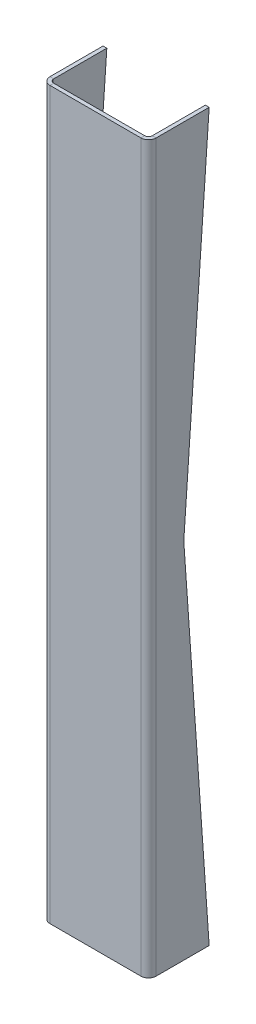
ISO-10303-21;
HEADER;
FILE_DESCRIPTION(('STEP AP214'),'2;1');
FILE_NAME('part.step','',(''),(''),'','','');
FILE_SCHEMA(('AUTOMOTIVE_DESIGN { 1 0 10303 214 1 1 1 1 }'));
ENDSEC;
DATA;
#1=APPLICATION_CONTEXT('core data for automotive mechanical design processes');
#2=APPLICATION_PROTOCOL_DEFINITION('international standard','automotive_design',2000,#1);
#3=PRODUCT_CONTEXT('',#1,'mechanical');
#4=PRODUCT('Part','Part','',(#3));
#5=PRODUCT_RELATED_PRODUCT_CATEGORY('part','',(#4));
#6=PRODUCT_DEFINITION_FORMATION('','',#4);
#7=PRODUCT_DEFINITION_CONTEXT('part definition',#1,'design');
#8=PRODUCT_DEFINITION('design','',#6,#7);
#9=PRODUCT_DEFINITION_SHAPE('','',#8);
#10=(LENGTH_UNIT() NAMED_UNIT(*) SI_UNIT(.MILLI.,.METRE.));
#11=(NAMED_UNIT(*) PLANE_ANGLE_UNIT() SI_UNIT($,.RADIAN.));
#12=(NAMED_UNIT(*) SI_UNIT($,.STERADIAN.) SOLID_ANGLE_UNIT());
#13=UNCERTAINTY_MEASURE_WITH_UNIT(LENGTH_MEASURE(1.E-05),#10,'distance_accuracy_value','');
#14=(GEOMETRIC_REPRESENTATION_CONTEXT(3) GLOBAL_UNCERTAINTY_ASSIGNED_CONTEXT((#13)) GLOBAL_UNIT_ASSIGNED_CONTEXT((#10,
#11,#12)) REPRESENTATION_CONTEXT('',''));
#15=CARTESIAN_POINT('',(0.,0.,0.));
#16=DIRECTION('',(0.,0.,1.));
#17=DIRECTION('',(1.,0.,0.));
#18=AXIS2_PLACEMENT_3D('',#15,#16,#17);
#19=CARTESIAN_POINT('',(88.9,1216.025,0.));
#20=DIRECTION('',(1.,0.,0.));
#21=DIRECTION('',(0.,0.,-1.));
#22=AXIS2_PLACEMENT_3D('',#19,#20,#21);
#23=PLANE('',#22);
#24=DIRECTION('',(0.,0.997564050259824,0.0697564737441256));
#25=VECTOR('',#24,1.);
#26=CARTESIAN_POINT('',(88.9,1217.17785767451,-16.4866328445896));
#27=LINE('',#26,#25);
#28=CARTESIAN_POINT('',(88.9,0.,-101.6));
#29=VERTEX_POINT('',#28);
#30=CARTESIAN_POINT('',(88.9,608.0125,-59.0836242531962));
#31=VERTEX_POINT('',#30);
#32=EDGE_CURVE('E270',#29,#31,#27,.T.);
#33=ORIENTED_EDGE('',*,*,#32,.T.);
#34=DIRECTION('',(0.,0.997564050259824,-0.0697564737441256));
#35=VECTOR('',#34,1.);
#36=CARTESIAN_POINT('',(88.9,1208.95500647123,-101.105617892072));
#37=LINE('',#36,#35);
#38=CARTESIAN_POINT('',(88.9,1216.025,-101.6));
#39=VERTEX_POINT('',#38);
#40=EDGE_CURVE('E236',#31,#39,#37,.T.);
#41=ORIENTED_EDGE('',*,*,#40,.T.);
#42=DIRECTION('',(0.,0.,1.));
#43=VECTOR('',#42,1.);
#44=CARTESIAN_POINT('',(88.9,1216.025,0.));
#45=LINE('',#44,#43);
#46=CARTESIAN_POINT('',(88.9,1216.025,-12.7));
#47=VERTEX_POINT('',#46);
#48=EDGE_CURVE('E223',#39,#47,#45,.T.);
#49=ORIENTED_EDGE('',*,*,#48,.T.);
#50=DIRECTION('',(0.,-1.,0.));
#51=VECTOR('',#50,1.);
#52=CARTESIAN_POINT('',(88.9,1216.025,-12.7));
#53=LINE('',#52,#51);
#54=CARTESIAN_POINT('',(88.9,0.,-12.7));
#55=VERTEX_POINT('',#54);
#56=EDGE_CURVE('E196',#47,#55,#53,.T.);
#57=ORIENTED_EDGE('',*,*,#56,.T.);
#58=DIRECTION('',(0.,0.,1.));
#59=VECTOR('',#58,1.);
#60=CARTESIAN_POINT('',(88.9,0.,0.));
#61=LINE('',#60,#59);
#62=EDGE_CURVE('E177',#29,#55,#61,.T.);
#63=ORIENTED_EDGE('',*,*,#62,.F.);
#64=EDGE_LOOP('',(#33,#41,#49,#57,#63));
#65=FACE_BOUND('',#64,.T.);
#66=ADVANCED_FACE('F38',(#65),#23,.T.);
#67=CARTESIAN_POINT('',(82.55,1216.025,0.));
#68=DIRECTION('',(1.,0.,0.));
#69=DIRECTION('',(0.,0.,-1.));
#70=AXIS2_PLACEMENT_3D('',#67,#68,#69);
#71=PLANE('',#70);
#72=DIRECTION('',(0.,0.997564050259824,-0.0697564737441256));
#73=VECTOR('',#72,1.);
#74=CARTESIAN_POINT('',(82.55,1208.95500647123,-101.105617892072));
#75=LINE('',#74,#73);
#76=CARTESIAN_POINT('',(82.55,608.0125,-59.0836242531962));
#77=VERTEX_POINT('',#76);
#78=CARTESIAN_POINT('',(82.55,1216.025,-101.6));
#79=VERTEX_POINT('',#78);
#80=EDGE_CURVE('E272',#77,#79,#75,.T.);
#81=ORIENTED_EDGE('',*,*,#80,.F.);
#82=DIRECTION('',(0.,0.997564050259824,0.0697564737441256));
#83=VECTOR('',#82,1.);
#84=CARTESIAN_POINT('',(82.55,1217.17785767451,-16.4866328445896));
#85=LINE('',#84,#83);
#86=CARTESIAN_POINT('',(82.55,0.,-101.6));
#87=VERTEX_POINT('',#86);
#88=EDGE_CURVE('E269',#87,#77,#85,.T.);
#89=ORIENTED_EDGE('',*,*,#88,.F.);
#90=DIRECTION('',(0.,0.,-1.));
#91=VECTOR('',#90,1.);
#92=CARTESIAN_POINT('',(82.55,0.,0.));
#93=LINE('',#92,#91);
#94=CARTESIAN_POINT('',(82.55,0.,-12.7));
#95=VERTEX_POINT('',#94);
#96=EDGE_CURVE('E183',#87,#95,#93,.F.);
#97=ORIENTED_EDGE('',*,*,#96,.T.);
#98=DIRECTION('',(0.,-1.,0.));
#99=VECTOR('',#98,1.);
#100=CARTESIAN_POINT('',(82.55,1216.025,-12.7));
#101=LINE('',#100,#99);
#102=CARTESIAN_POINT('',(82.55,1216.025,-12.7));
#103=VERTEX_POINT('',#102);
#104=EDGE_CURVE('E148',#103,#95,#101,.T.);
#105=ORIENTED_EDGE('',*,*,#104,.F.);
#106=DIRECTION('',(0.,0.,-1.));
#107=VECTOR('',#106,1.);
#108=CARTESIAN_POINT('',(82.55,1216.025,0.));
#109=LINE('',#108,#107);
#110=EDGE_CURVE('E139',#79,#103,#109,.F.);
#111=ORIENTED_EDGE('',*,*,#110,.F.);
#112=EDGE_LOOP('',(#81,#89,#97,#105,#111));
#113=FACE_BOUND('',#112,.T.);
#114=ADVANCED_FACE('F283',(#113),#71,.F.);
#115=CARTESIAN_POINT('',(-82.55,1216.025,0.));
#116=DIRECTION('',(-1.,0.,0.));
#117=DIRECTION('',(0.,0.,1.));
#118=AXIS2_PLACEMENT_3D('',#115,#116,#117);
#119=PLANE('',#118);
#120=DIRECTION('',(0.,-0.997564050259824,-0.0697564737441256));
#121=VECTOR('',#120,1.);
#122=CARTESIAN_POINT('',(-82.55,1217.17785767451,-16.4866328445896));
#123=LINE('',#122,#121);
#124=CARTESIAN_POINT('',(-82.55,608.0125,-59.0836242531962));
#125=VERTEX_POINT('',#124);
#126=CARTESIAN_POINT('',(-82.55,0.,-101.6));
#127=VERTEX_POINT('',#126);
#128=EDGE_CURVE('E259',#125,#127,#123,.T.);
#129=ORIENTED_EDGE('',*,*,#128,.F.);
#130=DIRECTION('',(0.,-0.997564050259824,0.0697564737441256));
#131=VECTOR('',#130,1.);
#132=CARTESIAN_POINT('',(-82.55,1208.95500647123,-101.105617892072));
#133=LINE('',#132,#131);
#134=CARTESIAN_POINT('',(-82.55,1216.025,-101.6));
#135=VERTEX_POINT('',#134);
#136=EDGE_CURVE('E255',#135,#125,#133,.T.);
#137=ORIENTED_EDGE('',*,*,#136,.F.);
#138=DIRECTION('',(0.,0.,-1.));
#139=VECTOR('',#138,1.);
#140=CARTESIAN_POINT('',(-82.55,1216.025,0.));
#141=LINE('',#140,#139);
#142=CARTESIAN_POINT('',(-82.55,1216.025,-12.7));
#143=VERTEX_POINT('',#142);
#144=EDGE_CURVE('E191',#143,#135,#141,.T.);
#145=ORIENTED_EDGE('',*,*,#144,.F.);
#146=DIRECTION('',(0.,-1.,0.));
#147=VECTOR('',#146,1.);
#148=CARTESIAN_POINT('',(-82.55,1216.025,-12.7));
#149=LINE('',#148,#147);
#150=CARTESIAN_POINT('',(-82.55,0.,-12.7));
#151=VERTEX_POINT('',#150);
#152=EDGE_CURVE('E156',#143,#151,#149,.T.);
#153=ORIENTED_EDGE('',*,*,#152,.T.);
#154=DIRECTION('',(0.,0.,-1.));
#155=VECTOR('',#154,1.);
#156=CARTESIAN_POINT('',(-82.55,0.,0.));
#157=LINE('',#156,#155);
#158=EDGE_CURVE('E160',#151,#127,#157,.T.);
#159=ORIENTED_EDGE('',*,*,#158,.T.);
#160=EDGE_LOOP('',(#129,#137,#145,#153,#159));
#161=FACE_BOUND('',#160,.T.);
#162=ADVANCED_FACE('F304',(#161),#119,.F.);
#163=CARTESIAN_POINT('',(-88.9,1216.025,0.));
#164=DIRECTION('',(-1.,0.,0.));
#165=DIRECTION('',(0.,0.,1.));
#166=AXIS2_PLACEMENT_3D('',#163,#164,#165);
#167=PLANE('',#166);
#168=DIRECTION('',(0.,-0.997564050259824,0.0697564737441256));
#169=VECTOR('',#168,1.);
#170=CARTESIAN_POINT('',(-88.9,1208.95500647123,-101.105617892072));
#171=LINE('',#170,#169);
#172=CARTESIAN_POINT('',(-88.9,1216.025,-101.6));
#173=VERTEX_POINT('',#172);
#174=CARTESIAN_POINT('',(-88.9,608.0125,-59.0836242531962));
#175=VERTEX_POINT('',#174);
#176=EDGE_CURVE('E256',#173,#175,#171,.T.);
#177=ORIENTED_EDGE('',*,*,#176,.T.);
#178=DIRECTION('',(0.,-0.997564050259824,-0.0697564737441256));
#179=VECTOR('',#178,1.);
#180=CARTESIAN_POINT('',(-88.9,1217.17785767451,-16.4866328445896));
#181=LINE('',#180,#179);
#182=CARTESIAN_POINT('',(-88.9,0.,-101.6));
#183=VERTEX_POINT('',#182);
#184=EDGE_CURVE('E260',#175,#183,#181,.T.);
#185=ORIENTED_EDGE('',*,*,#184,.T.);
#186=DIRECTION('',(0.,0.,-1.));
#187=VECTOR('',#186,1.);
#188=CARTESIAN_POINT('',(-88.9,0.,0.));
#189=LINE('',#188,#187);
#190=CARTESIAN_POINT('',(-88.9,0.,-12.7));
#191=VERTEX_POINT('',#190);
#192=EDGE_CURVE('E167',#191,#183,#189,.T.);
#193=ORIENTED_EDGE('',*,*,#192,.F.);
#194=DIRECTION('',(0.,-1.,0.));
#195=VECTOR('',#194,1.);
#196=CARTESIAN_POINT('',(-88.9,1216.025,-12.7));
#197=LINE('',#196,#195);
#198=CARTESIAN_POINT('',(-88.9,1216.025,-12.7));
#199=VERTEX_POINT('',#198);
#200=EDGE_CURVE('E205',#199,#191,#197,.T.);
#201=ORIENTED_EDGE('',*,*,#200,.F.);
#202=DIRECTION('',(0.,0.,-1.));
#203=VECTOR('',#202,1.);
#204=CARTESIAN_POINT('',(-88.9,1216.025,0.));
#205=LINE('',#204,#203);
#206=EDGE_CURVE('E246',#199,#173,#205,.T.);
#207=ORIENTED_EDGE('',*,*,#206,.T.);
#208=EDGE_LOOP('',(#177,#185,#193,#201,#207));
#209=FACE_BOUND('',#208,.T.);
#210=ADVANCED_FACE('F317',(#209),#167,.T.);
#211=CARTESIAN_POINT('',(76.2,1216.025,0.));
#212=DIRECTION('',(0.,1.,0.));
#213=DIRECTION('',(0.,0.,1.));
#214=AXIS2_PLACEMENT_3D('',#211,#212,#213);
#215=PLANE('',#214);
#216=DIRECTION('',(0.,0.,-1.));
#217=VECTOR('',#216,1.);
#218=CARTESIAN_POINT('',(76.2,1216.025,0.));
#219=LINE('',#218,#217);
#220=CARTESIAN_POINT('',(76.2,1216.025,0.));
#221=VERTEX_POINT('',#220);
#222=CARTESIAN_POINT('',(76.2,1216.025,-6.35));
#223=VERTEX_POINT('',#222);
#224=EDGE_CURVE('E11',#221,#223,#219,.T.);
#225=ORIENTED_EDGE('',*,*,#224,.F.);
#226=CARTESIAN_POINT('',(76.2,1216.025,-12.7));
#227=DIRECTION('',(0.,1.,0.));
#228=DIRECTION('',(0.,0.,1.));
#229=AXIS2_PLACEMENT_3D('',#226,#227,#228);
#230=CIRCLE('',#229,12.7);
#231=EDGE_CURVE('E229',#47,#221,#230,.F.);
#232=ORIENTED_EDGE('',*,*,#231,.F.);
#233=DIRECTION('',(1.,0.,0.));
#234=VECTOR('',#233,1.);
#235=CARTESIAN_POINT('',(82.55,1216.025,-12.7));
#236=LINE('',#235,#234);
#237=EDGE_CURVE('E47',#103,#47,#236,.T.);
#238=ORIENTED_EDGE('',*,*,#237,.F.);
#239=CARTESIAN_POINT('',(76.2,1216.025,-12.7));
#240=DIRECTION('',(0.,1.,0.));
#241=DIRECTION('',(1.,0.,0.));
#242=AXIS2_PLACEMENT_3D('',#239,#240,#241);
#243=CIRCLE('',#242,6.35);
#244=EDGE_CURVE('E134',#103,#223,#243,.F.);
#245=ORIENTED_EDGE('',*,*,#244,.T.);
#246=EDGE_LOOP('',(#225,#232,#238,#245));
#247=FACE_BOUND('',#246,.T.);
#248=ADVANCED_FACE('F40',(#247),#215,.T.);
#249=CARTESIAN_POINT('',(82.55,1216.025,-12.7));
#250=DIRECTION('',(0.,1.,0.));
#251=DIRECTION('',(0.,0.,1.));
#252=AXIS2_PLACEMENT_3D('',#249,#250,#251);
#253=PLANE('',#252);
#254=DIRECTION('',(-1.,0.,0.));
#255=VECTOR('',#254,1.);
#256=CARTESIAN_POINT('',(-88.9,1216.025,0.));
#257=LINE('',#256,#255);
#258=CARTESIAN_POINT('',(-76.2,1216.025,0.));
#259=VERTEX_POINT('',#258);
#260=EDGE_CURVE('E128',#221,#259,#257,.T.);
#261=ORIENTED_EDGE('',*,*,#260,.F.);
#262=ORIENTED_EDGE('',*,*,#224,.T.);
#263=DIRECTION('',(1.,0.,0.));
#264=VECTOR('',#263,1.);
#265=CARTESIAN_POINT('',(-88.9,1216.025,-6.35));
#266=LINE('',#265,#264);
#267=CARTESIAN_POINT('',(-76.2,1216.025,-6.35));
#268=VERTEX_POINT('',#267);
#269=EDGE_CURVE('E125',#223,#268,#266,.F.);
#270=ORIENTED_EDGE('',*,*,#269,.T.);
#271=DIRECTION('',(0.,0.,1.));
#272=VECTOR('',#271,1.);
#273=CARTESIAN_POINT('',(-76.2,1216.025,-6.35));
#274=LINE('',#273,#272);
#275=EDGE_CURVE('E210',#268,#259,#274,.T.);
#276=ORIENTED_EDGE('',*,*,#275,.T.);
#277=EDGE_LOOP('',(#261,#262,#270,#276));
#278=FACE_BOUND('',#277,.T.);
#279=ADVANCED_FACE('F123',(#278),#253,.T.);
#280=CARTESIAN_POINT('',(88.9,0.,-12.7));
#281=DIRECTION('',(0.,-1.,0.));
#282=DIRECTION('',(0.,0.,-1.));
#283=AXIS2_PLACEMENT_3D('',#280,#281,#282);
#284=PLANE('',#283);
#285=DIRECTION('',(-1.,0.,0.));
#286=VECTOR('',#285,1.);
#287=CARTESIAN_POINT('',(88.9,0.,-12.7));
#288=LINE('',#287,#286);
#289=EDGE_CURVE('E215',#55,#95,#288,.T.);
#290=ORIENTED_EDGE('',*,*,#289,.F.);
#291=CARTESIAN_POINT('',(76.2,0.,-12.7));
#292=DIRECTION('',(0.,1.,0.));
#293=DIRECTION('',(0.,0.,1.));
#294=AXIS2_PLACEMENT_3D('',#291,#292,#293);
#295=CIRCLE('',#294,12.7);
#296=CARTESIAN_POINT('',(76.2,0.,0.));
#297=VERTEX_POINT('',#296);
#298=EDGE_CURVE('E174',#55,#297,#295,.F.);
#299=ORIENTED_EDGE('',*,*,#298,.T.);
#300=DIRECTION('',(0.,0.,1.));
#301=VECTOR('',#300,1.);
#302=CARTESIAN_POINT('',(76.2,0.,-6.35));
#303=LINE('',#302,#301);
#304=CARTESIAN_POINT('',(76.2,0.,-6.35));
#305=VERTEX_POINT('',#304);
#306=EDGE_CURVE('E213',#305,#297,#303,.T.);
#307=ORIENTED_EDGE('',*,*,#306,.F.);
#308=CARTESIAN_POINT('',(76.2,0.,-12.7));
#309=DIRECTION('',(0.,1.,0.));
#310=DIRECTION('',(1.,0.,0.));
#311=AXIS2_PLACEMENT_3D('',#308,#309,#310);
#312=CIRCLE('',#311,6.35);
#313=EDGE_CURVE('E146',#95,#305,#312,.F.);
#314=ORIENTED_EDGE('',*,*,#313,.F.);
#315=EDGE_LOOP('',(#290,#299,#307,#314));
#316=FACE_BOUND('',#315,.T.);
#317=ADVANCED_FACE('F286',(#316),#284,.T.);
#318=CARTESIAN_POINT('',(76.2,0.,-6.35));
#319=DIRECTION('',(0.,-1.,0.));
#320=DIRECTION('',(0.,0.,-1.));
#321=AXIS2_PLACEMENT_3D('',#318,#319,#320);
#322=PLANE('',#321);
#323=ORIENTED_EDGE('',*,*,#62,.T.);
#324=ORIENTED_EDGE('',*,*,#289,.T.);
#325=ORIENTED_EDGE('',*,*,#96,.F.);
#326=DIRECTION('',(1.,0.,0.));
#327=VECTOR('',#326,1.);
#328=CARTESIAN_POINT('',(82.55,0.,-101.6));
#329=LINE('',#328,#327);
#330=EDGE_CURVE('E180',#87,#29,#329,.T.);
#331=ORIENTED_EDGE('',*,*,#330,.T.);
#332=EDGE_LOOP('',(#323,#324,#325,#331));
#333=FACE_BOUND('',#332,.T.);
#334=ADVANCED_FACE('F339',(#333),#322,.T.);
#335=CARTESIAN_POINT('',(-88.9,1216.025,-12.7));
#336=DIRECTION('',(0.,1.,0.));
#337=DIRECTION('',(0.,0.,1.));
#338=AXIS2_PLACEMENT_3D('',#335,#336,#337);
#339=PLANE('',#338);
#340=DIRECTION('',(1.,0.,0.));
#341=VECTOR('',#340,1.);
#342=CARTESIAN_POINT('',(-88.9,1216.025,-12.7));
#343=LINE('',#342,#341);
#344=EDGE_CURVE('E55',#199,#143,#343,.T.);
#345=ORIENTED_EDGE('',*,*,#344,.F.);
#346=CARTESIAN_POINT('',(-76.2,1216.025,-12.7));
#347=DIRECTION('',(0.,1.,0.));
#348=DIRECTION('',(0.,0.,1.));
#349=AXIS2_PLACEMENT_3D('',#346,#347,#348);
#350=CIRCLE('',#349,12.7);
#351=EDGE_CURVE('E243',#259,#199,#350,.F.);
#352=ORIENTED_EDGE('',*,*,#351,.F.);
#353=ORIENTED_EDGE('',*,*,#275,.F.);
#354=CARTESIAN_POINT('',(-76.2,1216.025,-12.7));
#355=DIRECTION('',(0.,1.,0.));
#356=DIRECTION('',(1.,0.,0.));
#357=AXIS2_PLACEMENT_3D('',#354,#355,#356);
#358=CIRCLE('',#357,6.35);
#359=EDGE_CURVE('E154',#268,#143,#358,.F.);
#360=ORIENTED_EDGE('',*,*,#359,.T.);
#361=EDGE_LOOP('',(#345,#352,#353,#360));
#362=FACE_BOUND('',#361,.T.);
#363=ADVANCED_FACE('F341',(#362),#339,.T.);
#364=CARTESIAN_POINT('',(-76.2,1216.025,-6.35));
#365=DIRECTION('',(0.,1.,0.));
#366=DIRECTION('',(0.,0.,1.));
#367=AXIS2_PLACEMENT_3D('',#364,#365,#366);
#368=PLANE('',#367);
#369=ORIENTED_EDGE('',*,*,#206,.F.);
#370=ORIENTED_EDGE('',*,*,#344,.T.);
#371=ORIENTED_EDGE('',*,*,#144,.T.);
#372=DIRECTION('',(1.,0.,0.));
#373=VECTOR('',#372,1.);
#374=CARTESIAN_POINT('',(-88.9,1216.025,-101.6));
#375=LINE('',#374,#373);
#376=EDGE_CURVE('E249',#173,#135,#375,.T.);
#377=ORIENTED_EDGE('',*,*,#376,.F.);
#378=EDGE_LOOP('',(#369,#370,#371,#377));
#379=FACE_BOUND('',#378,.T.);
#380=ADVANCED_FACE('F324',(#379),#368,.T.);
#381=CARTESIAN_POINT('',(-76.2,0.,0.));
#382=DIRECTION('',(0.,-1.,0.));
#383=DIRECTION('',(0.,0.,-1.));
#384=AXIS2_PLACEMENT_3D('',#381,#382,#383);
#385=PLANE('',#384);
#386=DIRECTION('',(0.,0.,-1.));
#387=VECTOR('',#386,1.);
#388=CARTESIAN_POINT('',(-76.2,0.,0.));
#389=LINE('',#388,#387);
#390=CARTESIAN_POINT('',(-76.2,0.,0.));
#391=VERTEX_POINT('',#390);
#392=CARTESIAN_POINT('',(-76.2,0.,-6.35));
#393=VERTEX_POINT('',#392);
#394=EDGE_CURVE('E88',#391,#393,#389,.T.);
#395=ORIENTED_EDGE('',*,*,#394,.F.);
#396=CARTESIAN_POINT('',(-76.2,0.,-12.7));
#397=DIRECTION('',(0.,1.,0.));
#398=DIRECTION('',(0.,0.,1.));
#399=AXIS2_PLACEMENT_3D('',#396,#397,#398);
#400=CIRCLE('',#399,12.7);
#401=EDGE_CURVE('E170',#391,#191,#400,.F.);
#402=ORIENTED_EDGE('',*,*,#401,.T.);
#403=DIRECTION('',(-1.,0.,0.));
#404=VECTOR('',#403,1.);
#405=CARTESIAN_POINT('',(-82.55,0.,-12.7));
#406=LINE('',#405,#404);
#407=EDGE_CURVE('E95',#151,#191,#406,.T.);
#408=ORIENTED_EDGE('',*,*,#407,.F.);
#409=CARTESIAN_POINT('',(-76.2,0.,-12.7));
#410=DIRECTION('',(0.,1.,0.));
#411=DIRECTION('',(1.,0.,0.));
#412=AXIS2_PLACEMENT_3D('',#409,#410,#411);
#413=CIRCLE('',#412,6.35);
#414=EDGE_CURVE('E189',#393,#151,#413,.F.);
#415=ORIENTED_EDGE('',*,*,#414,.F.);
#416=EDGE_LOOP('',(#395,#402,#408,#415));
#417=FACE_BOUND('',#416,.T.);
#418=ADVANCED_FACE('F296',(#417),#385,.T.);
#419=CARTESIAN_POINT('',(-82.55,0.,-12.7));
#420=DIRECTION('',(0.,-1.,0.));
#421=DIRECTION('',(0.,0.,-1.));
#422=AXIS2_PLACEMENT_3D('',#419,#420,#421);
#423=PLANE('',#422);
#424=DIRECTION('',(-1.,0.,0.));
#425=VECTOR('',#424,1.);
#426=CARTESIAN_POINT('',(-88.9,0.,0.));
#427=LINE('',#426,#425);
#428=EDGE_CURVE('E172',#297,#391,#427,.T.);
#429=ORIENTED_EDGE('',*,*,#428,.T.);
#430=ORIENTED_EDGE('',*,*,#394,.T.);
#431=DIRECTION('',(1.,0.,0.));
#432=VECTOR('',#431,1.);
#433=CARTESIAN_POINT('',(-88.9,0.,-6.35));
#434=LINE('',#433,#432);
#435=EDGE_CURVE('E187',#305,#393,#434,.F.);
#436=ORIENTED_EDGE('',*,*,#435,.F.);
#437=ORIENTED_EDGE('',*,*,#306,.T.);
#438=EDGE_LOOP('',(#429,#430,#436,#437));
#439=FACE_BOUND('',#438,.T.);
#440=ADVANCED_FACE('F287',(#439),#423,.T.);
#441=CARTESIAN_POINT('',(-76.2,1216.025,-12.7));
#442=DIRECTION('',(0.,-1.,0.));
#443=DIRECTION('',(0.,0.,-1.));
#444=AXIS2_PLACEMENT_3D('',#441,#442,#443);
#445=CYLINDRICAL_SURFACE('',#444,12.7);
#446=ORIENTED_EDGE('',*,*,#401,.F.);
#447=DIRECTION('',(0.,-1.,0.));
#448=VECTOR('',#447,1.);
#449=CARTESIAN_POINT('',(-76.2,1216.025,0.));
#450=LINE('',#449,#448);
#451=EDGE_CURVE('E202',#259,#391,#450,.T.);
#452=ORIENTED_EDGE('',*,*,#451,.F.);
#453=ORIENTED_EDGE('',*,*,#351,.T.);
#454=ORIENTED_EDGE('',*,*,#200,.T.);
#455=EDGE_LOOP('',(#446,#452,#453,#454));
#456=FACE_BOUND('',#455,.T.);
#457=ADVANCED_FACE('F294',(#456),#445,.T.);
#458=CARTESIAN_POINT('',(-88.9,1216.025,0.));
#459=DIRECTION('',(0.,0.,1.));
#460=DIRECTION('',(1.,0.,0.));
#461=AXIS2_PLACEMENT_3D('',#458,#459,#460);
#462=PLANE('',#461);
#463=ORIENTED_EDGE('',*,*,#428,.F.);
#464=DIRECTION('',(0.,-1.,0.));
#465=VECTOR('',#464,1.);
#466=CARTESIAN_POINT('',(76.2,1216.025,0.));
#467=LINE('',#466,#465);
#468=EDGE_CURVE('E199',#221,#297,#467,.T.);
#469=ORIENTED_EDGE('',*,*,#468,.F.);
#470=ORIENTED_EDGE('',*,*,#260,.T.);
#471=ORIENTED_EDGE('',*,*,#451,.T.);
#472=EDGE_LOOP('',(#463,#469,#470,#471));
#473=FACE_BOUND('',#472,.T.);
#474=ADVANCED_FACE('F290',(#473),#462,.T.);
#475=CARTESIAN_POINT('',(76.2,1216.025,-12.7));
#476=DIRECTION('',(0.,-1.,0.));
#477=DIRECTION('',(0.,0.,-1.));
#478=AXIS2_PLACEMENT_3D('',#475,#476,#477);
#479=CYLINDRICAL_SURFACE('',#478,12.7);
#480=ORIENTED_EDGE('',*,*,#298,.F.);
#481=ORIENTED_EDGE('',*,*,#56,.F.);
#482=ORIENTED_EDGE('',*,*,#231,.T.);
#483=ORIENTED_EDGE('',*,*,#468,.T.);
#484=EDGE_LOOP('',(#480,#481,#482,#483));
#485=FACE_BOUND('',#484,.T.);
#486=ADVANCED_FACE('F228',(#485),#479,.T.);
#487=CARTESIAN_POINT('',(76.2,1216.025,-12.7));
#488=DIRECTION('',(0.,-1.,0.));
#489=DIRECTION('',(0.,0.,-1.));
#490=AXIS2_PLACEMENT_3D('',#487,#488,#489);
#491=CYLINDRICAL_SURFACE('',#490,6.35);
#492=ORIENTED_EDGE('',*,*,#313,.T.);
#493=DIRECTION('',(0.,-1.,0.));
#494=VECTOR('',#493,1.);
#495=CARTESIAN_POINT('',(76.2,1216.025,-6.35));
#496=LINE('',#495,#494);
#497=EDGE_CURVE('E143',#223,#305,#496,.T.);
#498=ORIENTED_EDGE('',*,*,#497,.F.);
#499=ORIENTED_EDGE('',*,*,#244,.F.);
#500=ORIENTED_EDGE('',*,*,#104,.T.);
#501=EDGE_LOOP('',(#492,#498,#499,#500));
#502=FACE_BOUND('',#501,.T.);
#503=ADVANCED_FACE('F144',(#502),#491,.F.);
#504=CARTESIAN_POINT('',(-88.9,1216.025,-6.35));
#505=DIRECTION('',(0.,0.,1.));
#506=DIRECTION('',(1.,0.,0.));
#507=AXIS2_PLACEMENT_3D('',#504,#505,#506);
#508=PLANE('',#507);
#509=ORIENTED_EDGE('',*,*,#435,.T.);
#510=DIRECTION('',(0.,-1.,0.));
#511=VECTOR('',#510,1.);
#512=CARTESIAN_POINT('',(-76.2,1216.025,-6.35));
#513=LINE('',#512,#511);
#514=EDGE_CURVE('E149',#268,#393,#513,.T.);
#515=ORIENTED_EDGE('',*,*,#514,.F.);
#516=ORIENTED_EDGE('',*,*,#269,.F.);
#517=ORIENTED_EDGE('',*,*,#497,.T.);
#518=EDGE_LOOP('',(#509,#515,#516,#517));
#519=FACE_BOUND('',#518,.T.);
#520=ADVANCED_FACE('F151',(#519),#508,.F.);
#521=CARTESIAN_POINT('',(-76.2,1216.025,-12.7));
#522=DIRECTION('',(0.,-1.,0.));
#523=DIRECTION('',(0.,0.,-1.));
#524=AXIS2_PLACEMENT_3D('',#521,#522,#523);
#525=CYLINDRICAL_SURFACE('',#524,6.35);
#526=ORIENTED_EDGE('',*,*,#414,.T.);
#527=ORIENTED_EDGE('',*,*,#152,.F.);
#528=ORIENTED_EDGE('',*,*,#359,.F.);
#529=ORIENTED_EDGE('',*,*,#514,.T.);
#530=EDGE_LOOP('',(#526,#527,#528,#529));
#531=FACE_BOUND('',#530,.T.);
#532=ADVANCED_FACE('F299',(#531),#525,.F.);
#533=CARTESIAN_POINT('',(-76.2,1216.025,-12.7));
#534=DIRECTION('',(0.,1.,0.));
#535=DIRECTION('',(1.,0.,0.));
#536=AXIS2_PLACEMENT_3D('',#533,#534,#535);
#537=PLANE('',#536);
#538=ORIENTED_EDGE('',*,*,#110,.T.);
#539=ORIENTED_EDGE('',*,*,#237,.T.);
#540=ORIENTED_EDGE('',*,*,#48,.F.);
#541=DIRECTION('',(1.,0.,0.));
#542=VECTOR('',#541,1.);
#543=CARTESIAN_POINT('',(82.55,1216.025,-101.6));
#544=LINE('',#543,#542);
#545=EDGE_CURVE('E237',#79,#39,#544,.T.);
#546=ORIENTED_EDGE('',*,*,#545,.F.);
#547=EDGE_LOOP('',(#538,#539,#540,#546));
#548=FACE_BOUND('',#547,.T.);
#549=ADVANCED_FACE('F219',(#548),#537,.T.);
#550=CARTESIAN_POINT('',(-76.2,0.,-12.7));
#551=DIRECTION('',(0.,1.,0.));
#552=DIRECTION('',(1.,0.,0.));
#553=AXIS2_PLACEMENT_3D('',#550,#551,#552);
#554=PLANE('',#553);
#555=ORIENTED_EDGE('',*,*,#158,.F.);
#556=ORIENTED_EDGE('',*,*,#407,.T.);
#557=ORIENTED_EDGE('',*,*,#192,.T.);
#558=DIRECTION('',(1.,0.,0.));
#559=VECTOR('',#558,1.);
#560=CARTESIAN_POINT('',(-88.9,0.,-101.6));
#561=LINE('',#560,#559);
#562=EDGE_CURVE('E163',#183,#127,#561,.T.);
#563=ORIENTED_EDGE('',*,*,#562,.T.);
#564=EDGE_LOOP('',(#555,#556,#557,#563));
#565=FACE_BOUND('',#564,.T.);
#566=ADVANCED_FACE('F307',(#565),#554,.F.);
#567=CARTESIAN_POINT('',(-88.9,1217.17785767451,-16.4866328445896));
#568=DIRECTION('',(0.,0.0697564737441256,-0.997564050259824));
#569=DIRECTION('',(0.,-0.997564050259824,-0.0697564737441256));
#570=AXIS2_PLACEMENT_3D('',#567,#568,#569);
#571=PLANE('',#570);
#572=ORIENTED_EDGE('',*,*,#562,.F.);
#573=ORIENTED_EDGE('',*,*,#184,.F.);
#574=DIRECTION('',(-1.,0.,0.));
#575=VECTOR('',#574,1.);
#576=CARTESIAN_POINT('',(-88.9,608.0125,-59.0836242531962));
#577=LINE('',#576,#575);
#578=EDGE_CURVE('E164',#175,#125,#577,.F.);
#579=ORIENTED_EDGE('',*,*,#578,.T.);
#580=ORIENTED_EDGE('',*,*,#128,.T.);
#581=EDGE_LOOP('',(#572,#573,#579,#580));
#582=FACE_BOUND('',#581,.T.);
#583=ADVANCED_FACE('F311',(#582),#571,.T.);
#584=CARTESIAN_POINT('',(-88.9,1208.95500647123,-101.105617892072));
#585=DIRECTION('',(0.,-0.0697564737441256,-0.997564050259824));
#586=DIRECTION('',(0.,-0.997564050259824,0.0697564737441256));
#587=AXIS2_PLACEMENT_3D('',#584,#585,#586);
#588=PLANE('',#587);
#589=ORIENTED_EDGE('',*,*,#176,.F.);
#590=ORIENTED_EDGE('',*,*,#376,.T.);
#591=ORIENTED_EDGE('',*,*,#136,.T.);
#592=ORIENTED_EDGE('',*,*,#578,.F.);
#593=EDGE_LOOP('',(#589,#590,#591,#592));
#594=FACE_BOUND('',#593,.T.);
#595=ADVANCED_FACE('F323',(#594),#588,.T.);
#596=CARTESIAN_POINT('',(88.9,1208.95500647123,-101.105617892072));
#597=DIRECTION('',(0.,-0.0697564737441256,-0.997564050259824));
#598=DIRECTION('',(0.,0.997564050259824,-0.0697564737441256));
#599=AXIS2_PLACEMENT_3D('',#596,#597,#598);
#600=PLANE('',#599);
#601=ORIENTED_EDGE('',*,*,#545,.T.);
#602=ORIENTED_EDGE('',*,*,#40,.F.);
#603=DIRECTION('',(1.,0.,0.));
#604=VECTOR('',#603,1.);
#605=CARTESIAN_POINT('',(88.9,608.0125,-59.0836242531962));
#606=LINE('',#605,#604);
#607=EDGE_CURVE('E263',#31,#77,#606,.F.);
#608=ORIENTED_EDGE('',*,*,#607,.T.);
#609=ORIENTED_EDGE('',*,*,#80,.T.);
#610=EDGE_LOOP('',(#601,#602,#608,#609));
#611=FACE_BOUND('',#610,.T.);
#612=ADVANCED_FACE('F278',(#611),#600,.T.);
#613=CARTESIAN_POINT('',(88.9,1217.17785767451,-16.4866328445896));
#614=DIRECTION('',(0.,0.0697564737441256,-0.997564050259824));
#615=DIRECTION('',(0.,0.997564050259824,0.0697564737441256));
#616=AXIS2_PLACEMENT_3D('',#613,#614,#615);
#617=PLANE('',#616);
#618=ORIENTED_EDGE('',*,*,#32,.F.);
#619=ORIENTED_EDGE('',*,*,#330,.F.);
#620=ORIENTED_EDGE('',*,*,#88,.T.);
#621=ORIENTED_EDGE('',*,*,#607,.F.);
#622=EDGE_LOOP('',(#618,#619,#620,#621));
#623=FACE_BOUND('',#622,.T.);
#624=ADVANCED_FACE('F337',(#623),#617,.T.);
#625=CLOSED_SHELL('',(#66,#114,#162,#210,#248,#279,#317,#334,#363,#380,#418,#440,#457,#474,#486,
#503,#520,#532,#549,#566,#583,#595,#612,#624));
#626=MANIFOLD_SOLID_BREP('B2',#625);
#627=ADVANCED_BREP_SHAPE_REPRESENTATION('',(#18,#626),#14);
#628=SHAPE_DEFINITION_REPRESENTATION(#9,#627);
ENDSEC;
END-ISO-10303-21;
